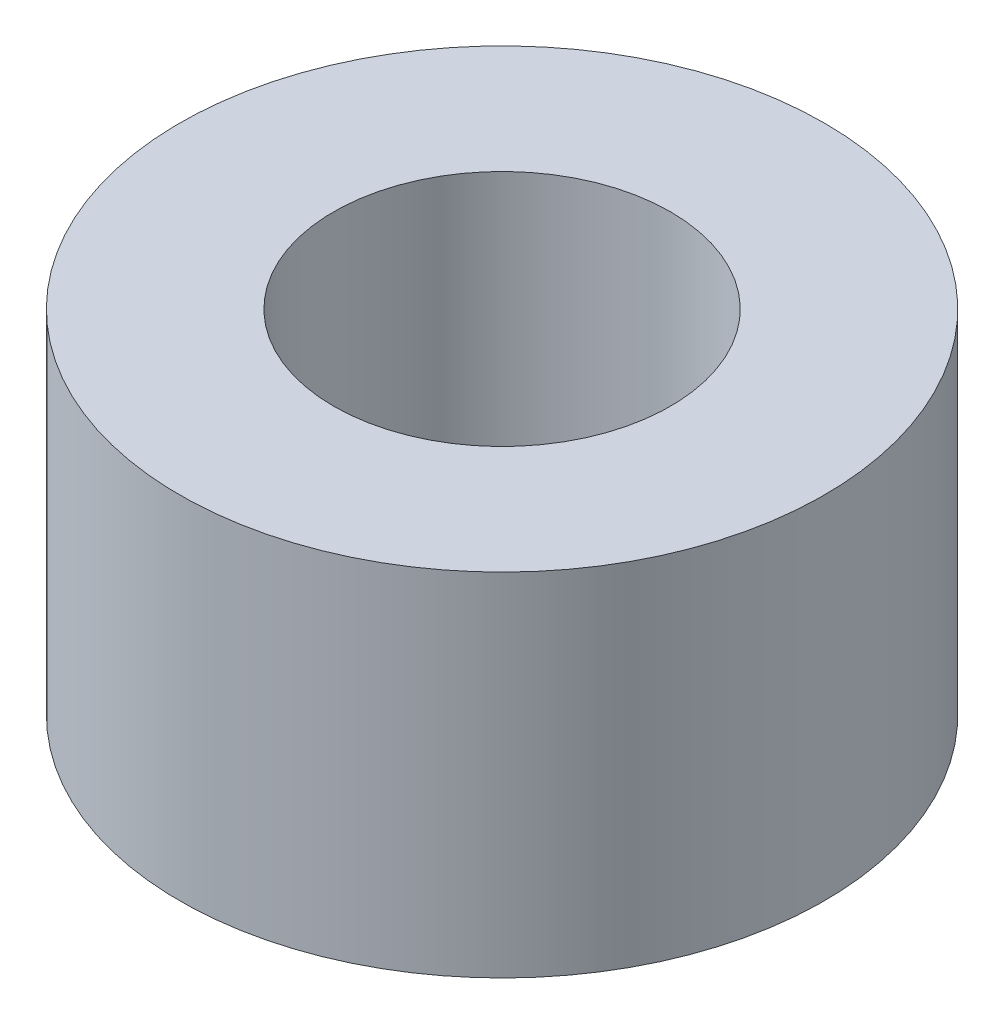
ISO-10303-21;
HEADER;
FILE_DESCRIPTION(('STEP AP214'),'2;1');
FILE_NAME('part.step','',(''),(''),'','','');
FILE_SCHEMA(('AUTOMOTIVE_DESIGN { 1 0 10303 214 1 1 1 1 }'));
ENDSEC;
DATA;
#1=APPLICATION_CONTEXT('core data for automotive mechanical design processes');
#2=APPLICATION_PROTOCOL_DEFINITION('international standard','automotive_design',2000,#1);
#3=PRODUCT_CONTEXT('',#1,'mechanical');
#4=PRODUCT('Part','Part','',(#3));
#5=PRODUCT_RELATED_PRODUCT_CATEGORY('part','',(#4));
#6=PRODUCT_DEFINITION_FORMATION('','',#4);
#7=PRODUCT_DEFINITION_CONTEXT('part definition',#1,'design');
#8=PRODUCT_DEFINITION('design','',#6,#7);
#9=PRODUCT_DEFINITION_SHAPE('','',#8);
#10=(LENGTH_UNIT() NAMED_UNIT(*) SI_UNIT(.MILLI.,.METRE.));
#11=(NAMED_UNIT(*) PLANE_ANGLE_UNIT() SI_UNIT($,.RADIAN.));
#12=(NAMED_UNIT(*) SI_UNIT($,.STERADIAN.) SOLID_ANGLE_UNIT());
#13=UNCERTAINTY_MEASURE_WITH_UNIT(LENGTH_MEASURE(1.E-05),#10,'distance_accuracy_value','');
#14=(GEOMETRIC_REPRESENTATION_CONTEXT(3) GLOBAL_UNCERTAINTY_ASSIGNED_CONTEXT((#13)) GLOBAL_UNIT_ASSIGNED_CONTEXT((#10,
#11,#12)) REPRESENTATION_CONTEXT('',''));
#15=CARTESIAN_POINT('',(0.,0.,0.));
#16=DIRECTION('',(0.,0.,1.));
#17=DIRECTION('',(1.,0.,0.));
#18=AXIS2_PLACEMENT_3D('',#15,#16,#17);
#19=CARTESIAN_POINT('',(2.22044604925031E-13,19.0500000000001,0.));
#20=DIRECTION('',(0.,-1.,0.));
#21=DIRECTION('',(0.,0.,-1.));
#22=AXIS2_PLACEMENT_3D('',#19,#20,#21);
#23=CYLINDRICAL_SURFACE('',#22,17.4625);
#24=CARTESIAN_POINT('',(2.22044604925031E-13,19.0500000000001,0.));
#25=DIRECTION('',(0.,1.,0.));
#26=DIRECTION('',(0.,0.,1.));
#27=AXIS2_PLACEMENT_3D('',#24,#25,#26);
#28=CIRCLE('',#27,17.4625);
#29=CARTESIAN_POINT('',(2.22044604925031E-13,19.0500000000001,-17.4625000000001));
#30=VERTEX_POINT('',#29);
#31=EDGE_CURVE('E10',#30,#30,#28,.T.);
#32=CARTESIAN_POINT('',(0.,0.,0.));
#33=DIRECTION('',(0.,1.,0.));
#34=DIRECTION('',(0.,0.,1.));
#35=AXIS2_PLACEMENT_3D('',#32,#33,#34);
#36=CIRCLE('',#35,17.4625);
#37=CARTESIAN_POINT('',(2.21780233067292E-13,0.,-17.4625000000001));
#38=VERTEX_POINT('',#37);
#39=EDGE_CURVE('E37',#38,#38,#36,.T.);
#40=CARTESIAN_POINT('',(2.22044604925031E-13,19.0500000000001,-17.4625000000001));
#41=CARTESIAN_POINT('',(2.22041851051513E-13,18.8515625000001,-17.4625000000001));
#42=CARTESIAN_POINT('',(2.22039097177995E-13,18.6531250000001,-17.4625000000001));
#43=CARTESIAN_POINT('',(2.22033589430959E-13,18.2562500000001,-17.4625000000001));
#44=CARTESIAN_POINT('',(2.22030835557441E-13,18.0578125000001,-17.4625000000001));
#45=CARTESIAN_POINT('',(2.22025327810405E-13,17.6609375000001,-17.4625000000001));
#46=CARTESIAN_POINT('',(2.22022573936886E-13,17.4625000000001,-17.4625000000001));
#47=CARTESIAN_POINT('',(2.2201706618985E-13,17.0656250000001,-17.4625000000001));
#48=CARTESIAN_POINT('',(2.22014312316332E-13,16.8671875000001,-17.4625000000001));
#49=CARTESIAN_POINT('',(2.22008804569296E-13,16.4703125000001,-17.4625000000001));
#50=CARTESIAN_POINT('',(2.22006050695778E-13,16.2718750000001,-17.4625000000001));
#51=CARTESIAN_POINT('',(2.22000542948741E-13,15.8750000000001,-17.4625000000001));
#52=CARTESIAN_POINT('',(2.21997789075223E-13,15.6765625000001,-17.4625000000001));
#53=CARTESIAN_POINT('',(2.21992281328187E-13,15.2796875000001,-17.4625000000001));
#54=CARTESIAN_POINT('',(2.21989527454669E-13,15.0812500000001,-17.4625000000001));
#55=CARTESIAN_POINT('',(2.21984019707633E-13,14.6843750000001,-17.4625000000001));
#56=CARTESIAN_POINT('',(2.21981265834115E-13,14.4859375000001,-17.4625000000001));
#57=CARTESIAN_POINT('',(2.21975758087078E-13,14.0890625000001,-17.4625000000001));
#58=CARTESIAN_POINT('',(2.2197300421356E-13,13.8906250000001,-17.4625000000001));
#59=CARTESIAN_POINT('',(2.21967496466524E-13,13.4937500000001,-17.4625000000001));
#60=CARTESIAN_POINT('',(2.21964742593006E-13,13.2953125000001,-17.4625000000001));
#61=CARTESIAN_POINT('',(2.2195923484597E-13,12.8984375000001,-17.4625000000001));
#62=CARTESIAN_POINT('',(2.21956480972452E-13,12.7000000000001,-17.4625000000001));
#63=CARTESIAN_POINT('',(2.21950973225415E-13,12.3031250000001,-17.4625000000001));
#64=CARTESIAN_POINT('',(2.21948219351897E-13,12.1046875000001,-17.4625000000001));
#65=CARTESIAN_POINT('',(2.21942711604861E-13,11.7078125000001,-17.4625000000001));
#66=CARTESIAN_POINT('',(2.21939957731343E-13,11.5093750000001,-17.4625000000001));
#67=CARTESIAN_POINT('',(2.21934449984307E-13,11.1125000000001,-17.4625000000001));
#68=CARTESIAN_POINT('',(2.21931696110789E-13,10.9140625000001,-17.4625000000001));
#69=CARTESIAN_POINT('',(2.21926188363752E-13,10.5171875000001,-17.4625000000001));
#70=CARTESIAN_POINT('',(2.21923434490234E-13,10.3187500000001,-17.4625000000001));
#71=CARTESIAN_POINT('',(2.21917926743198E-13,9.92187500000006,-17.4625000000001));
#72=CARTESIAN_POINT('',(2.2191517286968E-13,9.72343750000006,-17.4625000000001));
#73=CARTESIAN_POINT('',(2.21909665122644E-13,9.32656250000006,-17.4625000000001));
#74=CARTESIAN_POINT('',(2.21906911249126E-13,9.12812500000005,-17.4625000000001));
#75=CARTESIAN_POINT('',(2.21901403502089E-13,8.73125000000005,-17.4625000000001));
#76=CARTESIAN_POINT('',(2.21898649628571E-13,8.53281250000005,-17.4625000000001));
#77=CARTESIAN_POINT('',(2.21893141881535E-13,8.13593750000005,-17.4625000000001));
#78=CARTESIAN_POINT('',(2.21890388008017E-13,7.93750000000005,-17.4625000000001));
#79=CARTESIAN_POINT('',(2.21884880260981E-13,7.54062500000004,-17.4625000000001));
#80=CARTESIAN_POINT('',(2.21882126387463E-13,7.34218750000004,-17.4625000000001));
#81=CARTESIAN_POINT('',(2.21876618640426E-13,6.94531250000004,-17.4625000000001));
#82=CARTESIAN_POINT('',(2.21873864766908E-13,6.74687500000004,-17.4625000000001));
#83=CARTESIAN_POINT('',(2.21868357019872E-13,6.35000000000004,-17.4625000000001));
#84=CARTESIAN_POINT('',(2.21865603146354E-13,6.15156250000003,-17.4625000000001));
#85=CARTESIAN_POINT('',(2.21860095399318E-13,5.75468750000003,-17.4625000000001));
#86=CARTESIAN_POINT('',(2.218573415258E-13,5.55625000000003,-17.4625000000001));
#87=CARTESIAN_POINT('',(2.21851833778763E-13,5.15937500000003,-17.4625000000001));
#88=CARTESIAN_POINT('',(2.21849079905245E-13,4.96093750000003,-17.4625000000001));
#89=CARTESIAN_POINT('',(2.21843572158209E-13,4.56406250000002,-17.4625000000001));
#90=CARTESIAN_POINT('',(2.21840818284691E-13,4.36562500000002,-17.4625000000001));
#91=CARTESIAN_POINT('',(2.21835310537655E-13,3.96875000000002,-17.4625000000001));
#92=CARTESIAN_POINT('',(2.21832556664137E-13,3.77031250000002,-17.4625000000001));
#93=CARTESIAN_POINT('',(2.218270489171E-13,3.37343750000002,-17.4625000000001));
#94=CARTESIAN_POINT('',(2.21824295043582E-13,3.17500000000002,-17.4625000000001));
#95=CARTESIAN_POINT('',(2.21818787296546E-13,2.77812500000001,-17.4625000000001));
#96=CARTESIAN_POINT('',(2.21816033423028E-13,2.57968750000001,-17.4625000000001));
#97=CARTESIAN_POINT('',(2.21810525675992E-13,2.18281250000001,-17.4625000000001));
#98=CARTESIAN_POINT('',(2.21807771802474E-13,1.98437500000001,-17.4625000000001));
#99=CARTESIAN_POINT('',(2.21802264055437E-13,1.58750000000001,-17.4625000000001));
#100=CARTESIAN_POINT('',(2.21799510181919E-13,1.38906250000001,-17.4625000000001));
#101=CARTESIAN_POINT('',(2.21794002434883E-13,0.992187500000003,-17.4625000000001));
#102=CARTESIAN_POINT('',(2.21791248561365E-13,0.793750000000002,-17.4625000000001));
#103=CARTESIAN_POINT('',(2.21785740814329E-13,0.396874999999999,-17.4625000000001));
#104=CARTESIAN_POINT('',(2.21782986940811E-13,0.198437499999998,-17.4625000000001));
#105=CARTESIAN_POINT('',(2.21780233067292E-13,0.,-17.4625000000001));
#106=B_SPLINE_CURVE_WITH_KNOTS('',3,(#40,#41,#42,#43,#44,#45,#46,#47,#48,#49,#50,#51,#52,#53,
#54,#55,#56,#57,#58,#59,#60,#61,#62,#63,#64,#65,#66,#67,#68,#69,#70,#71,#72,#73,#74,#75,#76,#77,
#78,#79,#80,#81,#82,#83,#84,#85,#86,#87,#88,#89,#90,#91,#92,#93,#94,#95,#96,#97,#98,#99,#100,
#101,#102,#103,#104,#105),.UNSPECIFIED.,.F.,.F.,(4,2,2,2,2,2,2,2,2,2,2,2,2,2,2,2,2,2,2,2,2,2,2,
2,2,2,2,2,2,2,2,2,4),(0.,0.595312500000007,1.19062500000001,1.78593750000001,2.38125000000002,
2.97656250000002,3.57187500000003,4.16718750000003,4.76250000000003,5.35781250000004,
5.95312500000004,6.54843750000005,7.14375000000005,7.73906250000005,8.33437500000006,
8.92968750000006,9.52500000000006,10.1203125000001,10.7156250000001,11.3109375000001,
11.9062500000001,12.5015625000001,13.0968750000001,13.6921875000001,14.2875000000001,
14.8828125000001,15.4781250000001,16.0734375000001,16.6687500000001,17.2640625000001,
17.8593750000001,18.4546875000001,19.0500000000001),.UNSPECIFIED.);
#107=EDGE_CURVE('BSEAM34',#30,#38,#106,.T.);
#108=ORIENTED_EDGE('',*,*,#31,.F.);
#109=ORIENTED_EDGE('',*,*,#39,.T.);
#110=ORIENTED_EDGE('',*,*,#107,.T.);
#111=ORIENTED_EDGE('',*,*,#107,.F.);
#112=EDGE_LOOP('',(#108,#110,#109,#111));
#113=FACE_BOUND('',#112,.T.);
#114=ADVANCED_FACE('F34',(#113),#23,.T.);
#115=CARTESIAN_POINT('',(2.22044604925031E-13,19.0500000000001,0.));
#116=DIRECTION('',(0.,1.,0.));
#117=DIRECTION('',(0.,0.,1.));
#118=AXIS2_PLACEMENT_3D('',#115,#116,#117);
#119=PLANE('',#118);
#120=CARTESIAN_POINT('',(2.22044604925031E-13,19.0500000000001,0.));
#121=DIRECTION('',(0.,1.,0.));
#122=DIRECTION('',(0.,0.,1.));
#123=AXIS2_PLACEMENT_3D('',#120,#121,#122);
#124=CIRCLE('',#123,9.12812499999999);
#125=CARTESIAN_POINT('',(2.22044604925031E-13,19.0500000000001,9.12812499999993));
#126=VERTEX_POINT('',#125);
#127=EDGE_CURVE('E48',#126,#126,#124,.T.);
#128=ORIENTED_EDGE('',*,*,#127,.F.);
#129=EDGE_LOOP('',(#128));
#130=FACE_BOUND('',#129,.T.);
#131=ORIENTED_EDGE('',*,*,#31,.T.);
#132=EDGE_LOOP('',(#131));
#133=FACE_BOUND('',#132,.T.);
#134=ADVANCED_FACE('F54',(#130,#133),#119,.T.);
#135=CARTESIAN_POINT('',(0.,0.,0.));
#136=DIRECTION('',(0.,1.,0.));
#137=DIRECTION('',(0.,0.,1.));
#138=AXIS2_PLACEMENT_3D('',#135,#136,#137);
#139=PLANE('',#138);
#140=CARTESIAN_POINT('',(0.,0.,0.));
#141=DIRECTION('',(0.,1.,0.));
#142=DIRECTION('',(0.,0.,1.));
#143=AXIS2_PLACEMENT_3D('',#140,#141,#142);
#144=CIRCLE('',#143,9.128125);
#145=CARTESIAN_POINT('',(0.,0.,9.12812499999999));
#146=VERTEX_POINT('',#145);
#147=EDGE_CURVE('E44',#146,#146,#144,.T.);
#148=ORIENTED_EDGE('',*,*,#147,.T.);
#149=EDGE_LOOP('',(#148));
#150=FACE_BOUND('',#149,.T.);
#151=ORIENTED_EDGE('',*,*,#39,.F.);
#152=EDGE_LOOP('',(#151));
#153=FACE_BOUND('',#152,.T.);
#154=ADVANCED_FACE('F56',(#150,#153),#139,.F.);
#155=CARTESIAN_POINT('',(2.22044604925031E-13,19.0500000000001,0.));
#156=DIRECTION('',(0.,1.,0.));
#157=DIRECTION('',(0.,0.,1.));
#158=AXIS2_PLACEMENT_3D('',#155,#156,#157);
#159=CYLINDRICAL_SURFACE('',#158,9.12812499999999);
#160=ORIENTED_EDGE('',*,*,#147,.F.);
#161=EDGE_LOOP('',(#160));
#162=FACE_BOUND('',#161,.T.);
#163=ORIENTED_EDGE('',*,*,#127,.T.);
#164=EDGE_LOOP('',(#163));
#165=FACE_BOUND('',#164,.T.);
#166=ADVANCED_FACE('F52',(#162,#165),#159,.F.);
#167=CLOSED_SHELL('',(#114,#134,#154,#166));
#168=MANIFOLD_SOLID_BREP('B2',#167);
#169=ADVANCED_BREP_SHAPE_REPRESENTATION('',(#18,#168),#14);
#170=SHAPE_DEFINITION_REPRESENTATION(#9,#169);
ENDSEC;
END-ISO-10303-21;
